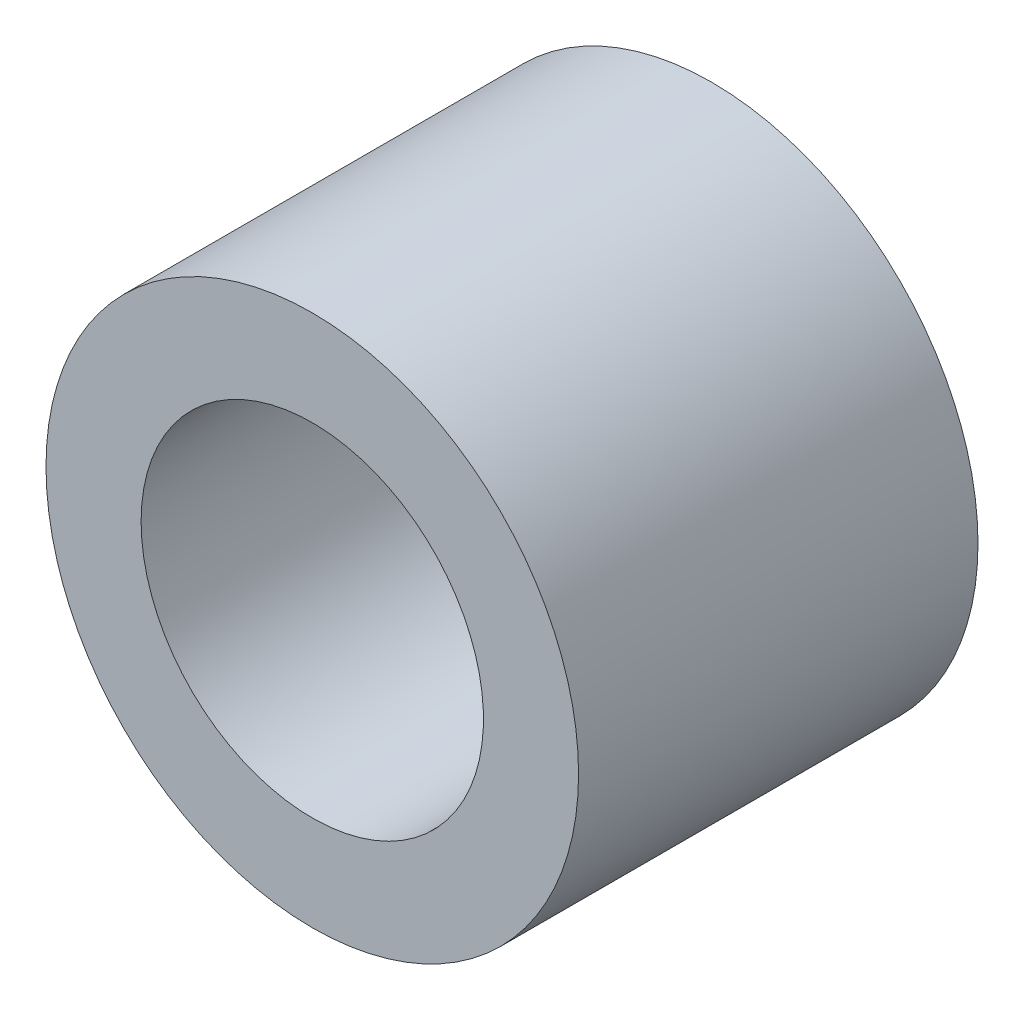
ISO-10303-21;
HEADER;
FILE_DESCRIPTION(('STEP AP214'),'2;1');
FILE_NAME('part.step','',(''),(''),'','','');
FILE_SCHEMA(('AUTOMOTIVE_DESIGN { 1 0 10303 214 1 1 1 1 }'));
ENDSEC;
DATA;
#1=APPLICATION_CONTEXT('core data for automotive mechanical design processes');
#2=APPLICATION_PROTOCOL_DEFINITION('international standard','automotive_design',2000,#1);
#3=PRODUCT_CONTEXT('',#1,'mechanical');
#4=PRODUCT('Part','Part','',(#3));
#5=PRODUCT_RELATED_PRODUCT_CATEGORY('part','',(#4));
#6=PRODUCT_DEFINITION_FORMATION('','',#4);
#7=PRODUCT_DEFINITION_CONTEXT('part definition',#1,'design');
#8=PRODUCT_DEFINITION('design','',#6,#7);
#9=PRODUCT_DEFINITION_SHAPE('','',#8);
#10=(LENGTH_UNIT() NAMED_UNIT(*) SI_UNIT(.MILLI.,.METRE.));
#11=(NAMED_UNIT(*) PLANE_ANGLE_UNIT() SI_UNIT($,.RADIAN.));
#12=(NAMED_UNIT(*) SI_UNIT($,.STERADIAN.) SOLID_ANGLE_UNIT());
#13=UNCERTAINTY_MEASURE_WITH_UNIT(LENGTH_MEASURE(1.E-05),#10,'distance_accuracy_value','');
#14=(GEOMETRIC_REPRESENTATION_CONTEXT(3) GLOBAL_UNCERTAINTY_ASSIGNED_CONTEXT((#13)) GLOBAL_UNIT_ASSIGNED_CONTEXT((#10,
#11,#12)) REPRESENTATION_CONTEXT('',''));
#15=CARTESIAN_POINT('',(0.,0.,0.));
#16=DIRECTION('',(0.,0.,1.));
#17=DIRECTION('',(1.,0.,0.));
#18=AXIS2_PLACEMENT_3D('',#15,#16,#17);
#19=CARTESIAN_POINT('',(0.,0.,21.));
#20=DIRECTION('',(0.,0.,1.));
#21=DIRECTION('',(1.,0.,0.));
#22=AXIS2_PLACEMENT_3D('',#19,#20,#21);
#23=PLANE('',#22);
#24=CARTESIAN_POINT('',(0.,0.,21.));
#25=DIRECTION('',(0.,0.,1.));
#26=DIRECTION('',(1.,0.,0.));
#27=AXIS2_PLACEMENT_3D('',#24,#25,#26);
#28=CIRCLE('',#27,28.);
#29=CARTESIAN_POINT('',(-28.,0.,21.));
#30=VERTEX_POINT('',#29);
#31=EDGE_CURVE('E10',#30,#30,#28,.T.);
#32=ORIENTED_EDGE('',*,*,#31,.T.);
#33=EDGE_LOOP('',(#32));
#34=FACE_BOUND('',#33,.T.);
#35=CARTESIAN_POINT('',(0.,0.,21.));
#36=DIRECTION('',(0.,0.,1.));
#37=DIRECTION('',(1.,0.,0.));
#38=AXIS2_PLACEMENT_3D('',#35,#36,#37);
#39=CIRCLE('',#38,18.);
#40=CARTESIAN_POINT('',(-18.,0.,21.));
#41=VERTEX_POINT('',#40);
#42=EDGE_CURVE('E50',#41,#41,#39,.T.);
#43=ORIENTED_EDGE('',*,*,#42,.F.);
#44=EDGE_LOOP('',(#43));
#45=FACE_BOUND('',#44,.T.);
#46=ADVANCED_FACE('F37',(#34,#45),#23,.T.);
#47=CARTESIAN_POINT('',(0.,0.,-21.));
#48=DIRECTION('',(0.,0.,1.));
#49=DIRECTION('',(1.,0.,0.));
#50=AXIS2_PLACEMENT_3D('',#47,#48,#49);
#51=PLANE('',#50);
#52=CARTESIAN_POINT('',(0.,0.,-21.));
#53=DIRECTION('',(0.,0.,1.));
#54=DIRECTION('',(1.,0.,0.));
#55=AXIS2_PLACEMENT_3D('',#52,#53,#54);
#56=CIRCLE('',#55,28.);
#57=CARTESIAN_POINT('',(-28.,0.,-21.));
#58=VERTEX_POINT('',#57);
#59=EDGE_CURVE('E41',#58,#58,#56,.T.);
#60=ORIENTED_EDGE('',*,*,#59,.F.);
#61=EDGE_LOOP('',(#60));
#62=FACE_BOUND('',#61,.T.);
#63=CARTESIAN_POINT('',(0.,0.,-21.));
#64=DIRECTION('',(0.,0.,1.));
#65=DIRECTION('',(1.,0.,0.));
#66=AXIS2_PLACEMENT_3D('',#63,#64,#65);
#67=CIRCLE('',#66,18.);
#68=CARTESIAN_POINT('',(-18.,0.,-21.));
#69=VERTEX_POINT('',#68);
#70=EDGE_CURVE('E52',#69,#69,#67,.T.);
#71=ORIENTED_EDGE('',*,*,#70,.T.);
#72=EDGE_LOOP('',(#71));
#73=FACE_BOUND('',#72,.T.);
#74=ADVANCED_FACE('F64',(#62,#73),#51,.F.);
#75=CARTESIAN_POINT('',(0.,0.,21.));
#76=DIRECTION('',(0.,0.,-1.));
#77=DIRECTION('',(-1.,0.,0.));
#78=AXIS2_PLACEMENT_3D('',#75,#76,#77);
#79=CYLINDRICAL_SURFACE('',#78,28.);
#80=CARTESIAN_POINT('',(-28.,0.,21.));
#81=CARTESIAN_POINT('',(-28.,0.,20.5625));
#82=CARTESIAN_POINT('',(-28.,0.,20.125));
#83=CARTESIAN_POINT('',(-28.,0.,19.25));
#84=CARTESIAN_POINT('',(-28.,0.,18.8125));
#85=CARTESIAN_POINT('',(-28.,0.,17.9375));
#86=CARTESIAN_POINT('',(-28.,0.,17.5));
#87=CARTESIAN_POINT('',(-28.,0.,16.625));
#88=CARTESIAN_POINT('',(-28.,0.,16.1875));
#89=CARTESIAN_POINT('',(-28.,0.,15.3125));
#90=CARTESIAN_POINT('',(-28.,0.,14.875));
#91=CARTESIAN_POINT('',(-28.,0.,14.));
#92=CARTESIAN_POINT('',(-28.,0.,13.5625));
#93=CARTESIAN_POINT('',(-28.,0.,12.6875));
#94=CARTESIAN_POINT('',(-28.,0.,12.25));
#95=CARTESIAN_POINT('',(-28.,0.,11.375));
#96=CARTESIAN_POINT('',(-28.,0.,10.9375));
#97=CARTESIAN_POINT('',(-28.,0.,10.0625));
#98=CARTESIAN_POINT('',(-28.,0.,9.625));
#99=CARTESIAN_POINT('',(-28.,0.,8.75));
#100=CARTESIAN_POINT('',(-28.,0.,8.3125));
#101=CARTESIAN_POINT('',(-28.,0.,7.4375));
#102=CARTESIAN_POINT('',(-28.,0.,7.));
#103=CARTESIAN_POINT('',(-28.,0.,6.125));
#104=CARTESIAN_POINT('',(-28.,0.,5.6875));
#105=CARTESIAN_POINT('',(-28.,0.,4.8125));
#106=CARTESIAN_POINT('',(-28.,0.,4.375));
#107=CARTESIAN_POINT('',(-28.,0.,3.5));
#108=CARTESIAN_POINT('',(-28.,0.,3.0625));
#109=CARTESIAN_POINT('',(-28.,0.,2.1875));
#110=CARTESIAN_POINT('',(-28.,0.,1.75));
#111=CARTESIAN_POINT('',(-28.,0.,0.875000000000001));
#112=CARTESIAN_POINT('',(-28.,0.,0.4375));
#113=CARTESIAN_POINT('',(-28.,0.,-0.4375));
#114=CARTESIAN_POINT('',(-28.,0.,-0.875000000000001));
#115=CARTESIAN_POINT('',(-28.,0.,-1.75));
#116=CARTESIAN_POINT('',(-28.,0.,-2.1875));
#117=CARTESIAN_POINT('',(-28.,0.,-3.0625));
#118=CARTESIAN_POINT('',(-28.,0.,-3.5));
#119=CARTESIAN_POINT('',(-28.,0.,-4.375));
#120=CARTESIAN_POINT('',(-28.,0.,-4.8125));
#121=CARTESIAN_POINT('',(-28.,0.,-5.6875));
#122=CARTESIAN_POINT('',(-28.,0.,-6.125));
#123=CARTESIAN_POINT('',(-28.,0.,-7.));
#124=CARTESIAN_POINT('',(-28.,0.,-7.4375));
#125=CARTESIAN_POINT('',(-28.,0.,-8.3125));
#126=CARTESIAN_POINT('',(-28.,0.,-8.75));
#127=CARTESIAN_POINT('',(-28.,0.,-9.625));
#128=CARTESIAN_POINT('',(-28.,0.,-10.0625));
#129=CARTESIAN_POINT('',(-28.,0.,-10.9375));
#130=CARTESIAN_POINT('',(-28.,0.,-11.375));
#131=CARTESIAN_POINT('',(-28.,0.,-12.25));
#132=CARTESIAN_POINT('',(-28.,0.,-12.6875));
#133=CARTESIAN_POINT('',(-28.,0.,-13.5625));
#134=CARTESIAN_POINT('',(-28.,0.,-14.));
#135=CARTESIAN_POINT('',(-28.,0.,-14.875));
#136=CARTESIAN_POINT('',(-28.,0.,-15.3125));
#137=CARTESIAN_POINT('',(-28.,0.,-16.1875));
#138=CARTESIAN_POINT('',(-28.,0.,-16.625));
#139=CARTESIAN_POINT('',(-28.,0.,-17.5));
#140=CARTESIAN_POINT('',(-28.,0.,-17.9375));
#141=CARTESIAN_POINT('',(-28.,0.,-18.8125));
#142=CARTESIAN_POINT('',(-28.,0.,-19.25));
#143=CARTESIAN_POINT('',(-28.,0.,-20.125));
#144=CARTESIAN_POINT('',(-28.,0.,-20.5625));
#145=CARTESIAN_POINT('',(-28.,0.,-21.));
#146=B_SPLINE_CURVE_WITH_KNOTS('',3,(#80,#81,#82,#83,#84,#85,#86,#87,#88,#89,#90,#91,#92,#93,
#94,#95,#96,#97,#98,#99,#100,#101,#102,#103,#104,#105,#106,#107,#108,#109,#110,#111,#112,#113,
#114,#115,#116,#117,#118,#119,#120,#121,#122,#123,#124,#125,#126,#127,#128,#129,#130,#131,#132,
#133,#134,#135,#136,#137,#138,#139,#140,#141,#142,#143,#144,#145),.UNSPECIFIED.,.F.,.F.,(4,2,2,
2,2,2,2,2,2,2,2,2,2,2,2,2,2,2,2,2,2,2,2,2,2,2,2,2,2,2,2,2,4),(0.,1.3125,2.625,3.9375,5.25,
6.5625,7.875,9.1875,10.5,11.8125,13.125,14.4375,15.75,17.0625,18.375,19.6875,21.,22.3125,23.625,
24.9375,26.25,27.5625,28.875,30.1875,31.5,32.8125,34.125,35.4375,36.75,38.0625,39.375,40.6875,
42.),.UNSPECIFIED.);
#147=EDGE_CURVE('BSEAM39',#30,#58,#146,.T.);
#148=ORIENTED_EDGE('',*,*,#31,.F.);
#149=ORIENTED_EDGE('',*,*,#59,.T.);
#150=ORIENTED_EDGE('',*,*,#147,.T.);
#151=ORIENTED_EDGE('',*,*,#147,.F.);
#152=EDGE_LOOP('',(#148,#150,#149,#151));
#153=FACE_BOUND('',#152,.T.);
#154=ADVANCED_FACE('F39',(#153),#79,.T.);
#155=CARTESIAN_POINT('',(0.,0.,21.));
#156=DIRECTION('',(0.,0.,-1.));
#157=DIRECTION('',(-1.,0.,0.));
#158=AXIS2_PLACEMENT_3D('',#155,#156,#157);
#159=CYLINDRICAL_SURFACE('',#158,18.);
#160=CARTESIAN_POINT('',(-18.,0.,21.));
#161=CARTESIAN_POINT('',(-18.,0.,20.5625));
#162=CARTESIAN_POINT('',(-18.,0.,20.125));
#163=CARTESIAN_POINT('',(-18.,0.,19.25));
#164=CARTESIAN_POINT('',(-18.,0.,18.8125));
#165=CARTESIAN_POINT('',(-18.,0.,17.9375));
#166=CARTESIAN_POINT('',(-18.,0.,17.5));
#167=CARTESIAN_POINT('',(-18.,0.,16.625));
#168=CARTESIAN_POINT('',(-18.,0.,16.1875));
#169=CARTESIAN_POINT('',(-18.,0.,15.3125));
#170=CARTESIAN_POINT('',(-18.,0.,14.875));
#171=CARTESIAN_POINT('',(-18.,0.,14.));
#172=CARTESIAN_POINT('',(-18.,0.,13.5625));
#173=CARTESIAN_POINT('',(-18.,0.,12.6875));
#174=CARTESIAN_POINT('',(-18.,0.,12.25));
#175=CARTESIAN_POINT('',(-18.,0.,11.375));
#176=CARTESIAN_POINT('',(-18.,0.,10.9375));
#177=CARTESIAN_POINT('',(-18.,0.,10.0625));
#178=CARTESIAN_POINT('',(-18.,0.,9.625));
#179=CARTESIAN_POINT('',(-18.,0.,8.75));
#180=CARTESIAN_POINT('',(-18.,0.,8.3125));
#181=CARTESIAN_POINT('',(-18.,0.,7.4375));
#182=CARTESIAN_POINT('',(-18.,0.,7.));
#183=CARTESIAN_POINT('',(-18.,0.,6.125));
#184=CARTESIAN_POINT('',(-18.,0.,5.6875));
#185=CARTESIAN_POINT('',(-18.,0.,4.8125));
#186=CARTESIAN_POINT('',(-18.,0.,4.375));
#187=CARTESIAN_POINT('',(-18.,0.,3.5));
#188=CARTESIAN_POINT('',(-18.,0.,3.0625));
#189=CARTESIAN_POINT('',(-18.,0.,2.1875));
#190=CARTESIAN_POINT('',(-18.,0.,1.75));
#191=CARTESIAN_POINT('',(-18.,0.,0.875000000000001));
#192=CARTESIAN_POINT('',(-18.,0.,0.4375));
#193=CARTESIAN_POINT('',(-18.,0.,-0.4375));
#194=CARTESIAN_POINT('',(-18.,0.,-0.875000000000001));
#195=CARTESIAN_POINT('',(-18.,0.,-1.75));
#196=CARTESIAN_POINT('',(-18.,0.,-2.1875));
#197=CARTESIAN_POINT('',(-18.,0.,-3.0625));
#198=CARTESIAN_POINT('',(-18.,0.,-3.5));
#199=CARTESIAN_POINT('',(-18.,0.,-4.375));
#200=CARTESIAN_POINT('',(-18.,0.,-4.8125));
#201=CARTESIAN_POINT('',(-18.,0.,-5.6875));
#202=CARTESIAN_POINT('',(-18.,0.,-6.125));
#203=CARTESIAN_POINT('',(-18.,0.,-7.));
#204=CARTESIAN_POINT('',(-18.,0.,-7.4375));
#205=CARTESIAN_POINT('',(-18.,0.,-8.3125));
#206=CARTESIAN_POINT('',(-18.,0.,-8.75));
#207=CARTESIAN_POINT('',(-18.,0.,-9.625));
#208=CARTESIAN_POINT('',(-18.,0.,-10.0625));
#209=CARTESIAN_POINT('',(-18.,0.,-10.9375));
#210=CARTESIAN_POINT('',(-18.,0.,-11.375));
#211=CARTESIAN_POINT('',(-18.,0.,-12.25));
#212=CARTESIAN_POINT('',(-18.,0.,-12.6875));
#213=CARTESIAN_POINT('',(-18.,0.,-13.5625));
#214=CARTESIAN_POINT('',(-18.,0.,-14.));
#215=CARTESIAN_POINT('',(-18.,0.,-14.875));
#216=CARTESIAN_POINT('',(-18.,0.,-15.3125));
#217=CARTESIAN_POINT('',(-18.,0.,-16.1875));
#218=CARTESIAN_POINT('',(-18.,0.,-16.625));
#219=CARTESIAN_POINT('',(-18.,0.,-17.5));
#220=CARTESIAN_POINT('',(-18.,0.,-17.9375));
#221=CARTESIAN_POINT('',(-18.,0.,-18.8125));
#222=CARTESIAN_POINT('',(-18.,0.,-19.25));
#223=CARTESIAN_POINT('',(-18.,0.,-20.125));
#224=CARTESIAN_POINT('',(-18.,0.,-20.5625));
#225=CARTESIAN_POINT('',(-18.,0.,-21.));
#226=B_SPLINE_CURVE_WITH_KNOTS('',3,(#160,#161,#162,#163,#164,#165,#166,#167,#168,#169,#170,
#171,#172,#173,#174,#175,#176,#177,#178,#179,#180,#181,#182,#183,#184,#185,#186,#187,#188,#189,
#190,#191,#192,#193,#194,#195,#196,#197,#198,#199,#200,#201,#202,#203,#204,#205,#206,#207,#208,
#209,#210,#211,#212,#213,#214,#215,#216,#217,#218,#219,#220,#221,#222,#223,#224,#225),
.UNSPECIFIED.,.F.,.F.,(4,2,2,2,2,2,2,2,2,2,2,2,2,2,2,2,2,2,2,2,2,2,2,2,2,2,2,2,2,2,2,2,4),(0.,
1.3125,2.625,3.9375,5.25,6.5625,7.875,9.1875,10.5,11.8125,13.125,14.4375,15.75,17.0625,18.375,
19.6875,21.,22.3125,23.625,24.9375,26.25,27.5625,28.875,30.1875,31.5,32.8125,34.125,35.4375,
36.75,38.0625,39.375,40.6875,42.),.UNSPECIFIED.);
#227=EDGE_CURVE('BSEAM60',#41,#69,#226,.T.);
#228=ORIENTED_EDGE('',*,*,#42,.T.);
#229=ORIENTED_EDGE('',*,*,#70,.F.);
#230=ORIENTED_EDGE('',*,*,#227,.T.);
#231=ORIENTED_EDGE('',*,*,#227,.F.);
#232=EDGE_LOOP('',(#228,#230,#229,#231));
#233=FACE_BOUND('',#232,.T.);
#234=ADVANCED_FACE('F60',(#233),#159,.F.);
#235=CLOSED_SHELL('',(#46,#74,#154,#234));
#236=MANIFOLD_SOLID_BREP('B2',#235);
#237=ADVANCED_BREP_SHAPE_REPRESENTATION('',(#18,#236),#14);
#238=SHAPE_DEFINITION_REPRESENTATION(#9,#237);
ENDSEC;
END-ISO-10303-21;
